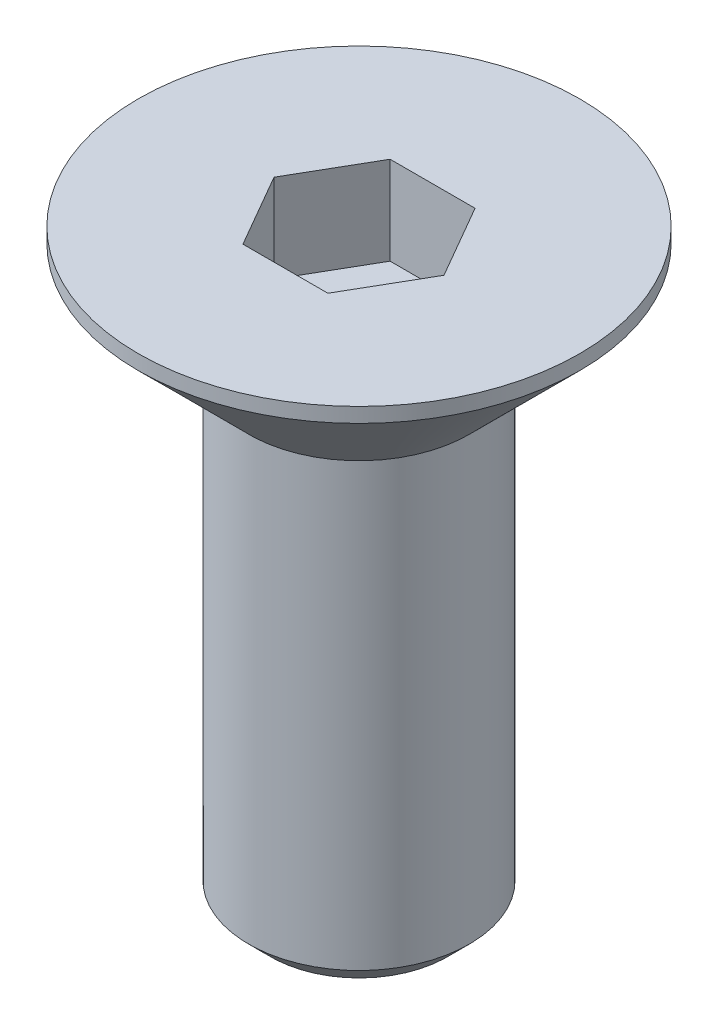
from build123d import *

# Parameters (mm, degrees)
CHANFREIN1_SIZE         = 0.3
ENL_V_MAT_EXTRU_1_DEPTH = 1.2


with BuildPart() as part:
    # Esquisse1 → R_volution1 (revolve)
    with BuildSketch(Plane.XY, mode=Mode.PRIVATE) as r_volution1_sk:
        Polygon((0, 0), (1.5, 0), (1.5, 6.3), (3, 7.8), (3, 8), (0, 8), align=None)
    revolve(r_volution1_sk.sketch.rotate(Axis((0, 0, 0), (0, 1, 0)), 90), axis=Axis((0, 0, 0), (0, 1, 0)))

    # Chanfrein1
    chanfrein1_edges = [part.edges().sort_by_distance(p)[0] for p in [
        (0, 0, 1.5),
    ]]
    chamfer(chanfrein1_edges, length=CHANFREIN1_SIZE)

    # Esquisse2 → Enl_v. mat.-Extru.1 (cut)
    with BuildSketch(Plane(origin=(0, 8, 0), x_dir=(-1, 0, 0), z_dir=(0, 1, 0))):
        Polygon((-0.577350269, 1), (-1.154700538, 0), (-0.577350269, -1), (0.577350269, -1), (1.154700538, 0), (0.577350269, 1), align=None)
    extrude(amount=-ENL_V_MAT_EXTRU_1_DEPTH, mode=Mode.SUBTRACT)


solid = part.part
